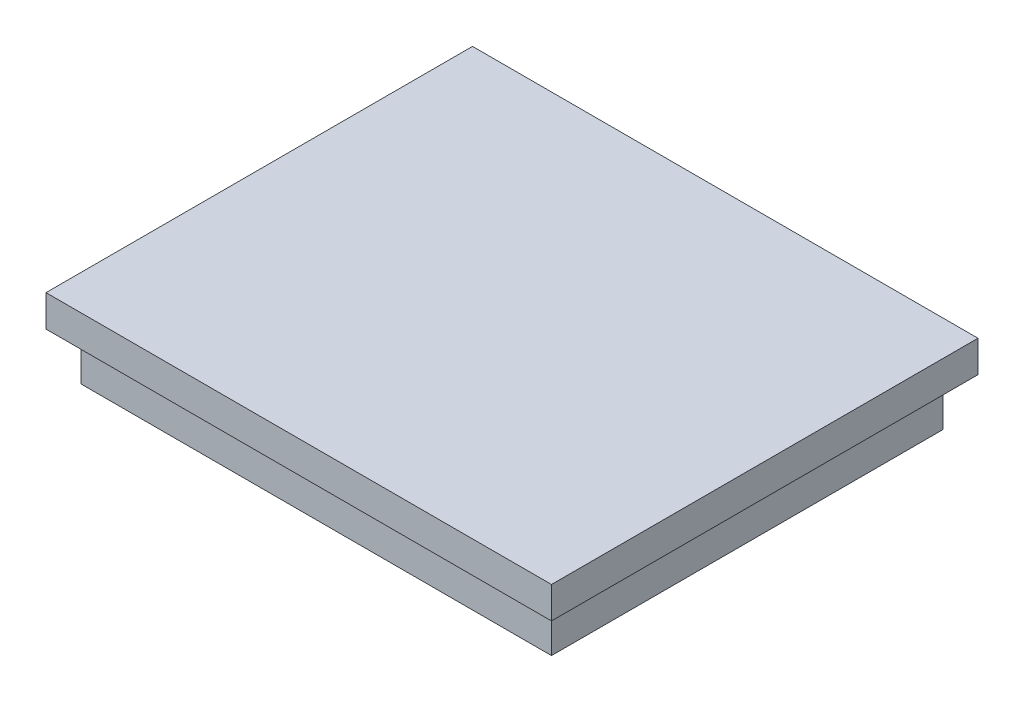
ISO-10303-21;
HEADER;
FILE_DESCRIPTION(('STEP AP214'),'2;1');
FILE_NAME('part.step','',(''),(''),'','','');
FILE_SCHEMA(('AUTOMOTIVE_DESIGN { 1 0 10303 214 1 1 1 1 }'));
ENDSEC;
DATA;
#1=APPLICATION_CONTEXT('core data for automotive mechanical design processes');
#2=APPLICATION_PROTOCOL_DEFINITION('international standard','automotive_design',2000,#1);
#3=PRODUCT_CONTEXT('',#1,'mechanical');
#4=PRODUCT('Part','Part','',(#3));
#5=PRODUCT_RELATED_PRODUCT_CATEGORY('part','',(#4));
#6=PRODUCT_DEFINITION_FORMATION('','',#4);
#7=PRODUCT_DEFINITION_CONTEXT('part definition',#1,'design');
#8=PRODUCT_DEFINITION('design','',#6,#7);
#9=PRODUCT_DEFINITION_SHAPE('','',#8);
#10=(LENGTH_UNIT() NAMED_UNIT(*) SI_UNIT(.MILLI.,.METRE.));
#11=(NAMED_UNIT(*) PLANE_ANGLE_UNIT() SI_UNIT($,.RADIAN.));
#12=(NAMED_UNIT(*) SI_UNIT($,.STERADIAN.) SOLID_ANGLE_UNIT());
#13=UNCERTAINTY_MEASURE_WITH_UNIT(LENGTH_MEASURE(1.E-05),#10,'distance_accuracy_value','');
#14=(GEOMETRIC_REPRESENTATION_CONTEXT(3) GLOBAL_UNCERTAINTY_ASSIGNED_CONTEXT((#13)) GLOBAL_UNIT_ASSIGNED_CONTEXT((#10,
#11,#12)) REPRESENTATION_CONTEXT('',''));
#15=CARTESIAN_POINT('',(0.,0.,0.));
#16=DIRECTION('',(0.,0.,1.));
#17=DIRECTION('',(1.,0.,0.));
#18=AXIS2_PLACEMENT_3D('',#15,#16,#17);
#19=CARTESIAN_POINT('',(-14.9,3.,12.4));
#20=DIRECTION('',(1.,0.,0.));
#21=DIRECTION('',(0.,0.,-1.));
#22=AXIS2_PLACEMENT_3D('',#19,#20,#21);
#23=PLANE('',#22);
#24=DIRECTION('',(0.,0.,1.));
#25=VECTOR('',#24,1.);
#26=CARTESIAN_POINT('',(-14.9,0.,12.4));
#27=LINE('',#26,#25);
#28=CARTESIAN_POINT('',(-14.9,0.,-12.4));
#29=VERTEX_POINT('',#28);
#30=CARTESIAN_POINT('',(-14.9,0.,12.4));
#31=VERTEX_POINT('',#30);
#32=EDGE_CURVE('E133',#29,#31,#27,.T.);
#33=ORIENTED_EDGE('',*,*,#32,.T.);
#34=DIRECTION('',(0.,-1.,0.));
#35=VECTOR('',#34,1.);
#36=CARTESIAN_POINT('',(-14.9,3.,12.4));
#37=LINE('',#36,#35);
#38=CARTESIAN_POINT('',(-14.9,3.,12.4));
#39=VERTEX_POINT('',#38);
#40=EDGE_CURVE('E11',#39,#31,#37,.T.);
#41=ORIENTED_EDGE('',*,*,#40,.F.);
#42=DIRECTION('',(0.,0.,1.));
#43=VECTOR('',#42,1.);
#44=CARTESIAN_POINT('',(-14.9,3.,12.4));
#45=LINE('',#44,#43);
#46=CARTESIAN_POINT('',(-14.9,3.,-12.4));
#47=VERTEX_POINT('',#46);
#48=EDGE_CURVE('E142',#47,#39,#45,.T.);
#49=ORIENTED_EDGE('',*,*,#48,.F.);
#50=DIRECTION('',(0.,-1.,0.));
#51=VECTOR('',#50,1.);
#52=CARTESIAN_POINT('',(-14.9,3.,-12.4));
#53=LINE('',#52,#51);
#54=EDGE_CURVE('E151',#47,#29,#53,.T.);
#55=ORIENTED_EDGE('',*,*,#54,.T.);
#56=EDGE_LOOP('',(#33,#41,#49,#55));
#57=FACE_BOUND('',#56,.T.);
#58=ADVANCED_FACE('F35',(#57),#23,.F.);
#59=CARTESIAN_POINT('',(14.9,3.,12.4));
#60=DIRECTION('',(0.,0.,-1.));
#61=DIRECTION('',(-1.,0.,0.));
#62=AXIS2_PLACEMENT_3D('',#59,#60,#61);
#63=PLANE('',#62);
#64=DIRECTION('',(1.,0.,0.));
#65=VECTOR('',#64,1.);
#66=CARTESIAN_POINT('',(14.9,0.,12.4));
#67=LINE('',#66,#65);
#68=CARTESIAN_POINT('',(14.9,0.,12.4));
#69=VERTEX_POINT('',#68);
#70=EDGE_CURVE('E136',#31,#69,#67,.T.);
#71=ORIENTED_EDGE('',*,*,#70,.T.);
#72=DIRECTION('',(0.,-1.,0.));
#73=VECTOR('',#72,1.);
#74=CARTESIAN_POINT('',(14.9,3.,12.4));
#75=LINE('',#74,#73);
#76=CARTESIAN_POINT('',(14.9,3.,12.4));
#77=VERTEX_POINT('',#76);
#78=EDGE_CURVE('E43',#77,#69,#75,.T.);
#79=ORIENTED_EDGE('',*,*,#78,.F.);
#80=DIRECTION('',(1.,0.,0.));
#81=VECTOR('',#80,1.);
#82=CARTESIAN_POINT('',(14.9,3.,12.4));
#83=LINE('',#82,#81);
#84=EDGE_CURVE('E77',#39,#77,#83,.T.);
#85=ORIENTED_EDGE('',*,*,#84,.F.);
#86=ORIENTED_EDGE('',*,*,#40,.T.);
#87=EDGE_LOOP('',(#71,#79,#85,#86));
#88=FACE_BOUND('',#87,.T.);
#89=ADVANCED_FACE('F177',(#88),#63,.F.);
#90=CARTESIAN_POINT('',(14.9,3.,12.4));
#91=DIRECTION('',(-1.,0.,0.));
#92=DIRECTION('',(0.,0.,1.));
#93=AXIS2_PLACEMENT_3D('',#90,#91,#92);
#94=PLANE('',#93);
#95=DIRECTION('',(0.,0.,-1.));
#96=VECTOR('',#95,1.);
#97=CARTESIAN_POINT('',(14.9,0.,12.4));
#98=LINE('',#97,#96);
#99=CARTESIAN_POINT('',(14.9,0.,-12.4));
#100=VERTEX_POINT('',#99);
#101=EDGE_CURVE('E67',#69,#100,#98,.T.);
#102=ORIENTED_EDGE('',*,*,#101,.T.);
#103=DIRECTION('',(0.,-1.,0.));
#104=VECTOR('',#103,1.);
#105=CARTESIAN_POINT('',(14.9,3.,-12.4));
#106=LINE('',#105,#104);
#107=CARTESIAN_POINT('',(14.9,3.,-12.4));
#108=VERTEX_POINT('',#107);
#109=EDGE_CURVE('E51',#108,#100,#106,.T.);
#110=ORIENTED_EDGE('',*,*,#109,.F.);
#111=DIRECTION('',(0.,0.,-1.));
#112=VECTOR('',#111,1.);
#113=CARTESIAN_POINT('',(14.9,3.,12.4));
#114=LINE('',#113,#112);
#115=EDGE_CURVE('E146',#77,#108,#114,.T.);
#116=ORIENTED_EDGE('',*,*,#115,.F.);
#117=ORIENTED_EDGE('',*,*,#78,.T.);
#118=EDGE_LOOP('',(#102,#110,#116,#117));
#119=FACE_BOUND('',#118,.T.);
#120=ADVANCED_FACE('F157',(#119),#94,.F.);
#121=CARTESIAN_POINT('',(14.9,3.,-12.4));
#122=DIRECTION('',(0.,0.,1.));
#123=DIRECTION('',(1.,0.,0.));
#124=AXIS2_PLACEMENT_3D('',#121,#122,#123);
#125=PLANE('',#124);
#126=DIRECTION('',(-1.,0.,0.));
#127=VECTOR('',#126,1.);
#128=CARTESIAN_POINT('',(14.9,0.,-12.4));
#129=LINE('',#128,#127);
#130=EDGE_CURVE('E72',#100,#29,#129,.T.);
#131=ORIENTED_EDGE('',*,*,#130,.T.);
#132=ORIENTED_EDGE('',*,*,#54,.F.);
#133=DIRECTION('',(-1.,0.,0.));
#134=VECTOR('',#133,1.);
#135=CARTESIAN_POINT('',(14.9,3.,-12.4));
#136=LINE('',#135,#134);
#137=EDGE_CURVE('E149',#108,#47,#136,.T.);
#138=ORIENTED_EDGE('',*,*,#137,.F.);
#139=ORIENTED_EDGE('',*,*,#109,.T.);
#140=EDGE_LOOP('',(#131,#132,#138,#139));
#141=FACE_BOUND('',#140,.T.);
#142=ADVANCED_FACE('F162',(#141),#125,.F.);
#143=CARTESIAN_POINT('',(0.,0.,0.));
#144=DIRECTION('',(0.,1.,0.));
#145=DIRECTION('',(0.,0.,1.));
#146=AXIS2_PLACEMENT_3D('',#143,#144,#145);
#147=PLANE('',#146);
#148=ORIENTED_EDGE('',*,*,#32,.F.);
#149=ORIENTED_EDGE('',*,*,#130,.F.);
#150=ORIENTED_EDGE('',*,*,#101,.F.);
#151=ORIENTED_EDGE('',*,*,#70,.F.);
#152=EDGE_LOOP('',(#148,#149,#150,#151));
#153=FACE_BOUND('',#152,.T.);
#154=ADVANCED_FACE('F160',(#153),#147,.F.);
#155=CARTESIAN_POINT('',(0.,3.,0.));
#156=DIRECTION('',(0.,1.,0.));
#157=DIRECTION('',(0.,0.,1.));
#158=AXIS2_PLACEMENT_3D('',#155,#156,#157);
#159=PLANE('',#158);
#160=DIRECTION('',(0.,0.,1.));
#161=VECTOR('',#160,1.);
#162=CARTESIAN_POINT('',(-16.,3.,13.5));
#163=LINE('',#162,#161);
#164=CARTESIAN_POINT('',(-16.,3.,-13.5));
#165=VERTEX_POINT('',#164);
#166=CARTESIAN_POINT('',(-16.,3.,13.5));
#167=VERTEX_POINT('',#166);
#168=EDGE_CURVE('E132',#165,#167,#163,.T.);
#169=ORIENTED_EDGE('',*,*,#168,.F.);
#170=DIRECTION('',(-1.,0.,0.));
#171=VECTOR('',#170,1.);
#172=CARTESIAN_POINT('',(16.,3.,-13.5));
#173=LINE('',#172,#171);
#174=CARTESIAN_POINT('',(16.,3.,-13.5));
#175=VERTEX_POINT('',#174);
#176=EDGE_CURVE('E128',#175,#165,#173,.T.);
#177=ORIENTED_EDGE('',*,*,#176,.F.);
#178=DIRECTION('',(0.,0.,-1.));
#179=VECTOR('',#178,1.);
#180=CARTESIAN_POINT('',(16.,3.,13.5));
#181=LINE('',#180,#179);
#182=CARTESIAN_POINT('',(16.,3.,13.5));
#183=VERTEX_POINT('',#182);
#184=EDGE_CURVE('E204',#183,#175,#181,.T.);
#185=ORIENTED_EDGE('',*,*,#184,.F.);
#186=DIRECTION('',(1.,0.,0.));
#187=VECTOR('',#186,1.);
#188=CARTESIAN_POINT('',(16.,3.,13.5));
#189=LINE('',#188,#187);
#190=EDGE_CURVE('E207',#167,#183,#189,.T.);
#191=ORIENTED_EDGE('',*,*,#190,.F.);
#192=EDGE_LOOP('',(#169,#177,#185,#191));
#193=FACE_BOUND('',#192,.T.);
#194=ORIENTED_EDGE('',*,*,#137,.T.);
#195=ORIENTED_EDGE('',*,*,#48,.T.);
#196=ORIENTED_EDGE('',*,*,#84,.T.);
#197=ORIENTED_EDGE('',*,*,#115,.T.);
#198=EDGE_LOOP('',(#194,#195,#196,#197));
#199=FACE_BOUND('',#198,.T.);
#200=ADVANCED_FACE('F164',(#193,#199),#159,.F.);
#201=CARTESIAN_POINT('',(-16.,5.,13.5));
#202=DIRECTION('',(1.,0.,0.));
#203=DIRECTION('',(0.,0.,-1.));
#204=AXIS2_PLACEMENT_3D('',#201,#202,#203);
#205=PLANE('',#204);
#206=ORIENTED_EDGE('',*,*,#168,.T.);
#207=DIRECTION('',(0.,-1.,0.));
#208=VECTOR('',#207,1.);
#209=CARTESIAN_POINT('',(-16.,5.,13.5));
#210=LINE('',#209,#208);
#211=CARTESIAN_POINT('',(-16.,5.,13.5));
#212=VERTEX_POINT('',#211);
#213=EDGE_CURVE('E112',#212,#167,#210,.T.);
#214=ORIENTED_EDGE('',*,*,#213,.F.);
#215=DIRECTION('',(0.,0.,1.));
#216=VECTOR('',#215,1.);
#217=CARTESIAN_POINT('',(-16.,5.,13.5));
#218=LINE('',#217,#216);
#219=CARTESIAN_POINT('',(-16.,5.,-13.5));
#220=VERTEX_POINT('',#219);
#221=EDGE_CURVE('E119',#220,#212,#218,.T.);
#222=ORIENTED_EDGE('',*,*,#221,.F.);
#223=DIRECTION('',(0.,-1.,0.));
#224=VECTOR('',#223,1.);
#225=CARTESIAN_POINT('',(-16.,5.,-13.5));
#226=LINE('',#225,#224);
#227=EDGE_CURVE('E201',#220,#165,#226,.T.);
#228=ORIENTED_EDGE('',*,*,#227,.T.);
#229=EDGE_LOOP('',(#206,#214,#222,#228));
#230=FACE_BOUND('',#229,.T.);
#231=ADVANCED_FACE('F130',(#230),#205,.F.);
#232=CARTESIAN_POINT('',(16.,5.,13.5));
#233=DIRECTION('',(0.,0.,-1.));
#234=DIRECTION('',(-1.,0.,0.));
#235=AXIS2_PLACEMENT_3D('',#232,#233,#234);
#236=PLANE('',#235);
#237=ORIENTED_EDGE('',*,*,#190,.T.);
#238=DIRECTION('',(0.,-1.,0.));
#239=VECTOR('',#238,1.);
#240=CARTESIAN_POINT('',(16.,5.,13.5));
#241=LINE('',#240,#239);
#242=CARTESIAN_POINT('',(16.,5.,13.5));
#243=VERTEX_POINT('',#242);
#244=EDGE_CURVE('E115',#243,#183,#241,.T.);
#245=ORIENTED_EDGE('',*,*,#244,.F.);
#246=DIRECTION('',(1.,0.,0.));
#247=VECTOR('',#246,1.);
#248=CARTESIAN_POINT('',(16.,5.,13.5));
#249=LINE('',#248,#247);
#250=EDGE_CURVE('E108',#212,#243,#249,.T.);
#251=ORIENTED_EDGE('',*,*,#250,.F.);
#252=ORIENTED_EDGE('',*,*,#213,.T.);
#253=EDGE_LOOP('',(#237,#245,#251,#252));
#254=FACE_BOUND('',#253,.T.);
#255=ADVANCED_FACE('F110',(#254),#236,.F.);
#256=CARTESIAN_POINT('',(16.,5.,13.5));
#257=DIRECTION('',(-1.,0.,0.));
#258=DIRECTION('',(0.,0.,1.));
#259=AXIS2_PLACEMENT_3D('',#256,#257,#258);
#260=PLANE('',#259);
#261=ORIENTED_EDGE('',*,*,#184,.T.);
#262=DIRECTION('',(0.,-1.,0.));
#263=VECTOR('',#262,1.);
#264=CARTESIAN_POINT('',(16.,5.,-13.5));
#265=LINE('',#264,#263);
#266=CARTESIAN_POINT('',(16.,5.,-13.5));
#267=VERTEX_POINT('',#266);
#268=EDGE_CURVE('E138',#267,#175,#265,.T.);
#269=ORIENTED_EDGE('',*,*,#268,.F.);
#270=DIRECTION('',(0.,0.,-1.));
#271=VECTOR('',#270,1.);
#272=CARTESIAN_POINT('',(16.,5.,13.5));
#273=LINE('',#272,#271);
#274=EDGE_CURVE('E118',#243,#267,#273,.T.);
#275=ORIENTED_EDGE('',*,*,#274,.F.);
#276=ORIENTED_EDGE('',*,*,#244,.T.);
#277=EDGE_LOOP('',(#261,#269,#275,#276));
#278=FACE_BOUND('',#277,.T.);
#279=ADVANCED_FACE('F190',(#278),#260,.F.);
#280=CARTESIAN_POINT('',(16.,5.,-13.5));
#281=DIRECTION('',(0.,0.,1.));
#282=DIRECTION('',(1.,0.,0.));
#283=AXIS2_PLACEMENT_3D('',#280,#281,#282);
#284=PLANE('',#283);
#285=ORIENTED_EDGE('',*,*,#176,.T.);
#286=ORIENTED_EDGE('',*,*,#227,.F.);
#287=DIRECTION('',(-1.,0.,0.));
#288=VECTOR('',#287,1.);
#289=CARTESIAN_POINT('',(16.,5.,-13.5));
#290=LINE('',#289,#288);
#291=EDGE_CURVE('E124',#267,#220,#290,.T.);
#292=ORIENTED_EDGE('',*,*,#291,.F.);
#293=ORIENTED_EDGE('',*,*,#268,.T.);
#294=EDGE_LOOP('',(#285,#286,#292,#293));
#295=FACE_BOUND('',#294,.T.);
#296=ADVANCED_FACE('F192',(#295),#284,.F.);
#297=CARTESIAN_POINT('',(0.,5.,0.));
#298=DIRECTION('',(0.,1.,0.));
#299=DIRECTION('',(0.,0.,1.));
#300=AXIS2_PLACEMENT_3D('',#297,#298,#299);
#301=PLANE('',#300);
#302=ORIENTED_EDGE('',*,*,#221,.T.);
#303=ORIENTED_EDGE('',*,*,#250,.T.);
#304=ORIENTED_EDGE('',*,*,#274,.T.);
#305=ORIENTED_EDGE('',*,*,#291,.T.);
#306=EDGE_LOOP('',(#302,#303,#304,#305));
#307=FACE_BOUND('',#306,.T.);
#308=ADVANCED_FACE('F122',(#307),#301,.T.);
#309=CLOSED_SHELL('',(#58,#89,#120,#142,#154,#200,#231,#255,#279,#296,#308));
#310=MANIFOLD_SOLID_BREP('B2',#309);
#311=ADVANCED_BREP_SHAPE_REPRESENTATION('',(#18,#310),#14);
#312=SHAPE_DEFINITION_REPRESENTATION(#9,#311);
ENDSEC;
END-ISO-10303-21;
